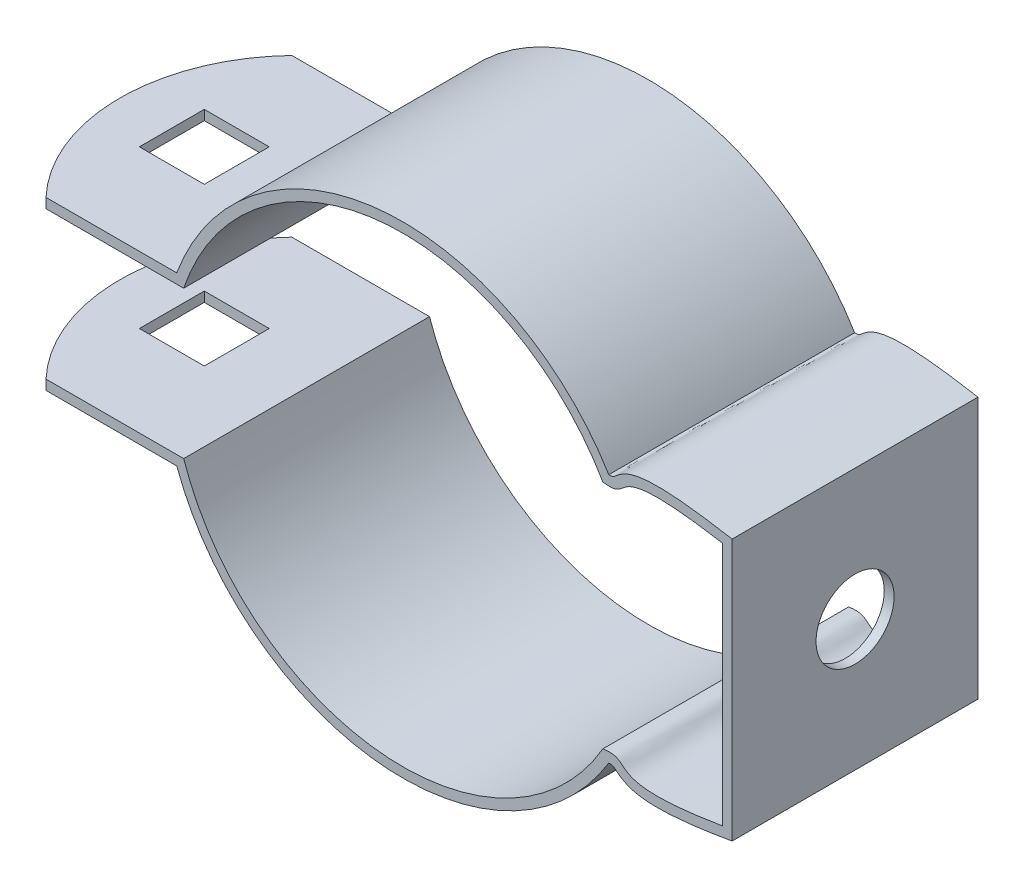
ISO-10303-21;
HEADER;
FILE_DESCRIPTION(('STEP AP214'),'2;1');
FILE_NAME('part.step','',(''),(''),'','','');
FILE_SCHEMA(('AUTOMOTIVE_DESIGN { 1 0 10303 214 1 1 1 1 }'));
ENDSEC;
DATA;
#1=APPLICATION_CONTEXT('core data for automotive mechanical design processes');
#2=APPLICATION_PROTOCOL_DEFINITION('international standard','automotive_design',2000,#1);
#3=PRODUCT_CONTEXT('',#1,'mechanical');
#4=PRODUCT('Part','Part','',(#3));
#5=PRODUCT_RELATED_PRODUCT_CATEGORY('part','',(#4));
#6=PRODUCT_DEFINITION_FORMATION('','',#4);
#7=PRODUCT_DEFINITION_CONTEXT('part definition',#1,'design');
#8=PRODUCT_DEFINITION('design','',#6,#7);
#9=PRODUCT_DEFINITION_SHAPE('','',#8);
#10=(LENGTH_UNIT() NAMED_UNIT(*) SI_UNIT(.MILLI.,.METRE.));
#11=(NAMED_UNIT(*) PLANE_ANGLE_UNIT() SI_UNIT($,.RADIAN.));
#12=(NAMED_UNIT(*) SI_UNIT($,.STERADIAN.) SOLID_ANGLE_UNIT());
#13=UNCERTAINTY_MEASURE_WITH_UNIT(LENGTH_MEASURE(1.E-05),#10,'distance_accuracy_value','');
#14=(GEOMETRIC_REPRESENTATION_CONTEXT(3) GLOBAL_UNCERTAINTY_ASSIGNED_CONTEXT((#13)) GLOBAL_UNIT_ASSIGNED_CONTEXT((#10,
#11,#12)) REPRESENTATION_CONTEXT('',''));
#15=CARTESIAN_POINT('',(0.,0.,0.));
#16=DIRECTION('',(0.,0.,1.));
#17=DIRECTION('',(1.,0.,0.));
#18=AXIS2_PLACEMENT_3D('',#15,#16,#17);
#19=CARTESIAN_POINT('',(-23.1460574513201,17.9950975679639,12.5));
#20=DIRECTION('',(0.,-1.,0.));
#21=DIRECTION('',(0.,0.,-1.));
#22=AXIS2_PLACEMENT_3D('',#19,#20,#21);
#23=CYLINDRICAL_SURFACE('',#22,18.125);
#24=CARTESIAN_POINT('',(-23.1460574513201,7.5,12.5));
#25=DIRECTION('',(0.,1.,0.));
#26=DIRECTION('',(0.,0.,1.));
#27=AXIS2_PLACEMENT_3D('',#24,#25,#26);
#28=CIRCLE('',#27,18.125);
#29=CARTESIAN_POINT('',(-36.2710574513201,7.5,25.));
#30=VERTEX_POINT('',#29);
#31=CARTESIAN_POINT('',(-36.2710574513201,7.49999999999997,0.));
#32=VERTEX_POINT('',#31);
#33=EDGE_CURVE('E267',#30,#32,#28,.F.);
#34=ORIENTED_EDGE('',*,*,#33,.F.);
#35=DIRECTION('',(0.,1.,0.));
#36=VECTOR('',#35,1.);
#37=CARTESIAN_POINT('',(-36.2710574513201,0.,25.));
#38=LINE('',#37,#36);
#39=CARTESIAN_POINT('',(-36.2710574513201,8.5,25.));
#40=VERTEX_POINT('',#39);
#41=EDGE_CURVE('E479',#30,#40,#38,.T.);
#42=ORIENTED_EDGE('',*,*,#41,.T.);
#43=CARTESIAN_POINT('',(-23.1460574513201,8.5,12.5));
#44=DIRECTION('',(0.,-1.,0.));
#45=DIRECTION('',(0.,0.,-1.));
#46=AXIS2_PLACEMENT_3D('',#43,#44,#45);
#47=CIRCLE('',#46,18.125);
#48=CARTESIAN_POINT('',(-36.2710574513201,8.49999999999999,0.));
#49=VERTEX_POINT('',#48);
#50=EDGE_CURVE('E269',#40,#49,#47,.T.);
#51=ORIENTED_EDGE('',*,*,#50,.T.);
#52=DIRECTION('',(0.,1.,0.));
#53=VECTOR('',#52,1.);
#54=CARTESIAN_POINT('',(-36.2710574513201,0.,0.));
#55=LINE('',#54,#53);
#56=EDGE_CURVE('E392',#32,#49,#55,.T.);
#57=ORIENTED_EDGE('',*,*,#56,.F.);
#58=EDGE_LOOP('',(#34,#42,#51,#57));
#59=FACE_BOUND('',#58,.T.);
#60=ADVANCED_FACE('F39',(#59),#23,.T.);
#61=CARTESIAN_POINT('',(33.5,0.,25.));
#62=DIRECTION('',(1.,0.,0.));
#63=DIRECTION('',(0.,0.,-1.));
#64=AXIS2_PLACEMENT_3D('',#61,#62,#63);
#65=PLANE('',#64);
#66=CARTESIAN_POINT('',(33.5,0.,12.5));
#67=DIRECTION('',(1.,0.,0.));
#68=DIRECTION('',(0.,0.,-1.));
#69=AXIS2_PLACEMENT_3D('',#66,#67,#68);
#70=CIRCLE('',#69,3.96875);
#71=CARTESIAN_POINT('',(33.5,0.,8.53125));
#72=VERTEX_POINT('',#71);
#73=EDGE_CURVE('E544',#72,#72,#70,.T.);
#74=ORIENTED_EDGE('',*,*,#73,.F.);
#75=EDGE_LOOP('',(#74));
#76=FACE_BOUND('',#75,.T.);
#77=DIRECTION('',(0.,-1.,0.));
#78=VECTOR('',#77,1.);
#79=CARTESIAN_POINT('',(33.5,0.,0.));
#80=LINE('',#79,#78);
#81=CARTESIAN_POINT('',(33.5,13.2980440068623,0.));
#82=VERTEX_POINT('',#81);
#83=CARTESIAN_POINT('',(33.5,-13.2980440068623,0.));
#84=VERTEX_POINT('',#83);
#85=EDGE_CURVE('E274',#82,#84,#80,.T.);
#86=ORIENTED_EDGE('',*,*,#85,.F.);
#87=DIRECTION('',(0.,0.,-1.));
#88=VECTOR('',#87,1.);
#89=CARTESIAN_POINT('',(33.5,13.2980440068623,25.));
#90=LINE('',#89,#88);
#91=CARTESIAN_POINT('',(33.5,13.2980440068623,25.));
#92=VERTEX_POINT('',#91);
#93=EDGE_CURVE('E11',#92,#82,#90,.T.);
#94=ORIENTED_EDGE('',*,*,#93,.F.);
#95=DIRECTION('',(0.,-1.,0.));
#96=VECTOR('',#95,1.);
#97=CARTESIAN_POINT('',(33.5,0.,25.));
#98=LINE('',#97,#96);
#99=CARTESIAN_POINT('',(33.5,-13.2980440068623,25.));
#100=VERTEX_POINT('',#99);
#101=EDGE_CURVE('E275',#92,#100,#98,.T.);
#102=ORIENTED_EDGE('',*,*,#101,.T.);
#103=DIRECTION('',(0.,0.,-1.));
#104=VECTOR('',#103,1.);
#105=CARTESIAN_POINT('',(33.5,-13.2980440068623,25.));
#106=LINE('',#105,#104);
#107=EDGE_CURVE('E372',#100,#84,#106,.T.);
#108=ORIENTED_EDGE('',*,*,#107,.T.);
#109=EDGE_LOOP('',(#86,#94,#102,#108));
#110=FACE_BOUND('',#109,.T.);
#111=ADVANCED_FACE('F41',(#76,#110),#65,.T.);
#112=CARTESIAN_POINT('',(33.5,13.2980440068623,25.));
#113=CARTESIAN_POINT('',(33.1257039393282,13.3613611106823,25.));
#114=CARTESIAN_POINT('',(32.366155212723,13.4916064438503,25.));
#115=CARTESIAN_POINT('',(30.9340694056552,13.7194128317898,25.));
#116=CARTESIAN_POINT('',(29.3573831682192,13.9332412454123,25.));
#117=CARTESIAN_POINT('',(27.7553723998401,14.0922761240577,25.));
#118=CARTESIAN_POINT('',(25.9681580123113,14.1876729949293,25.));
#119=CARTESIAN_POINT('',(24.3011945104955,14.1156624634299,25.));
#120=CARTESIAN_POINT('',(22.9263731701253,13.7887410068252,25.));
#121=CARTESIAN_POINT('',(21.9931802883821,13.2483976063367,25.));
#122=CARTESIAN_POINT('',(21.5780376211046,12.8712205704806,25.));
#123=CARTESIAN_POINT('',(21.4161476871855,12.7626210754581,25.));
#124=CARTESIAN_POINT('',(21.3496067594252,12.7308014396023,25.));
#125=CARTESIAN_POINT('',(21.2545690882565,12.7051360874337,25.));
#126=CARTESIAN_POINT('',(21.1154191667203,12.6914233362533,25.));
#127=CARTESIAN_POINT('',(21.0056229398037,12.6910655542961,25.));
#128=CARTESIAN_POINT('',(20.9557927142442,12.6927046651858,25.));
#129=B_SPLINE_CURVE_WITH_KNOTS('',3,(#112,#113,#114,#115,#116,#117,#118,#119,#120,#121,#122,
#123,#124,#125,#126,#127,#128),.UNSPECIFIED.,.F.,.F.,(4,1,1,1,1,1,1,1,1,1,1,1,1,1,4),
(0.0533151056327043,0.0790930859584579,0.104871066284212,0.156427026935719,0.207982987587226,
0.259538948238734,0.362650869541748,0.465762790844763,0.568874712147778,0.671986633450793,
0.7235425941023,0.775098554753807,0.826654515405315,0.852432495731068,0.878210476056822),.UNSPECIFIED.);
#130=DIRECTION('',(0.,0.,-1.));
#131=VECTOR('',#130,1.);
#132=SURFACE_OF_LINEAR_EXTRUSION('',#129,#131);
#133=CARTESIAN_POINT('',(33.5,13.2980440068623,0.));
#134=CARTESIAN_POINT('',(33.1257039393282,13.3613611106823,0.));
#135=CARTESIAN_POINT('',(32.366155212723,13.4916064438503,0.));
#136=CARTESIAN_POINT('',(30.9340694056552,13.7194128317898,0.));
#137=CARTESIAN_POINT('',(29.3573831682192,13.9332412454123,0.));
#138=CARTESIAN_POINT('',(27.7553723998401,14.0922761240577,0.));
#139=CARTESIAN_POINT('',(25.9681580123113,14.1876729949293,0.));
#140=CARTESIAN_POINT('',(24.3011945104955,14.1156624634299,0.));
#141=CARTESIAN_POINT('',(22.9263731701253,13.7887410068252,0.));
#142=CARTESIAN_POINT('',(21.9931802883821,13.2483976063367,0.));
#143=CARTESIAN_POINT('',(21.5780376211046,12.8712205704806,0.));
#144=CARTESIAN_POINT('',(21.4161476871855,12.7626210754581,0.));
#145=CARTESIAN_POINT('',(21.3496067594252,12.7308014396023,0.));
#146=CARTESIAN_POINT('',(21.2545690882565,12.7051360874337,0.));
#147=CARTESIAN_POINT('',(21.1154191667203,12.6914233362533,0.));
#148=CARTESIAN_POINT('',(21.0056229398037,12.6910655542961,0.));
#149=CARTESIAN_POINT('',(20.9557927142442,12.6927046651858,0.));
#150=B_SPLINE_CURVE_WITH_KNOTS('',3,(#133,#134,#135,#136,#137,#138,#139,#140,#141,#142,#143,
#144,#145,#146,#147,#148,#149),.UNSPECIFIED.,.F.,.F.,(4,1,1,1,1,1,1,1,1,1,1,1,1,1,4),
(0.0533151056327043,0.0790930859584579,0.104871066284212,0.156427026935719,0.207982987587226,
0.259538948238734,0.362650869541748,0.465762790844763,0.568874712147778,0.671986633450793,
0.7235425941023,0.775098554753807,0.826654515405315,0.852432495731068,0.878210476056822),.UNSPECIFIED.);
#151=CARTESIAN_POINT('',(20.9557927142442,12.6927046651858,0.));
#152=VERTEX_POINT('',#151);
#153=EDGE_CURVE('E380',#82,#152,#150,.T.);
#154=ORIENTED_EDGE('',*,*,#153,.T.);
#155=DIRECTION('',(0.,0.,-1.));
#156=VECTOR('',#155,1.);
#157=CARTESIAN_POINT('',(20.9557927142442,12.6927046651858,25.));
#158=LINE('',#157,#156);
#159=CARTESIAN_POINT('',(20.9557927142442,12.6927046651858,25.));
#160=VERTEX_POINT('',#159);
#161=EDGE_CURVE('E48',#160,#152,#158,.T.);
#162=ORIENTED_EDGE('',*,*,#161,.F.);
#163=EDGE_CURVE('E278',#92,#160,#129,.T.);
#164=ORIENTED_EDGE('',*,*,#163,.F.);
#165=ORIENTED_EDGE('',*,*,#93,.T.);
#166=EDGE_LOOP('',(#154,#162,#164,#165));
#167=FACE_BOUND('',#166,.T.);
#168=ADVANCED_FACE('F289',(#167),#132,.F.);
#169=CARTESIAN_POINT('',(0.,0.,25.));
#170=DIRECTION('',(0.,0.,-1.));
#171=DIRECTION('',(-1.,0.,0.));
#172=AXIS2_PLACEMENT_3D('',#169,#170,#171);
#173=CYLINDRICAL_SURFACE('',#172,24.5);
#174=CARTESIAN_POINT('',(0.,0.,0.));
#175=DIRECTION('',(0.,0.,1.));
#176=DIRECTION('',(1.,0.,0.));
#177=AXIS2_PLACEMENT_3D('',#174,#175,#176);
#178=CIRCLE('',#177,24.5);
#179=CARTESIAN_POINT('',(-22.9782505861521,8.49999999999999,0.));
#180=VERTEX_POINT('',#179);
#181=EDGE_CURVE('E384',#152,#180,#178,.T.);
#182=ORIENTED_EDGE('',*,*,#181,.T.);
#183=DIRECTION('',(0.,0.,-1.));
#184=VECTOR('',#183,1.);
#185=CARTESIAN_POINT('',(-22.9782505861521,8.49999999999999,25.));
#186=LINE('',#185,#184);
#187=CARTESIAN_POINT('',(-22.9782505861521,8.49999999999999,25.));
#188=VERTEX_POINT('',#187);
#189=EDGE_CURVE('E458',#188,#180,#186,.T.);
#190=ORIENTED_EDGE('',*,*,#189,.F.);
#191=CARTESIAN_POINT('',(0.,0.,25.));
#192=DIRECTION('',(0.,0.,1.));
#193=DIRECTION('',(1.,0.,0.));
#194=AXIS2_PLACEMENT_3D('',#191,#192,#193);
#195=CIRCLE('',#194,24.5);
#196=EDGE_CURVE('E284',#160,#188,#195,.T.);
#197=ORIENTED_EDGE('',*,*,#196,.F.);
#198=ORIENTED_EDGE('',*,*,#161,.T.);
#199=EDGE_LOOP('',(#182,#190,#197,#198));
#200=FACE_BOUND('',#199,.T.);
#201=ADVANCED_FACE('F292',(#200),#173,.T.);
#202=CARTESIAN_POINT('',(0.,8.5,25.));
#203=DIRECTION('',(0.,-1.,0.));
#204=DIRECTION('',(1.,0.,0.));
#205=AXIS2_PLACEMENT_3D('',#202,#203,#204);
#206=PLANE('',#205);
#207=DIRECTION('',(-1.,0.,0.));
#208=VECTOR('',#207,1.);
#209=CARTESIAN_POINT('',(0.,8.5,15.802));
#210=LINE('',#209,#208);
#211=CARTESIAN_POINT('',(-29.3742505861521,8.49999999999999,15.802));
#212=VERTEX_POINT('',#211);
#213=CARTESIAN_POINT('',(-35.9782505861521,8.49999999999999,15.802));
#214=VERTEX_POINT('',#213);
#215=EDGE_CURVE('E254',#212,#214,#210,.T.);
#216=ORIENTED_EDGE('',*,*,#215,.T.);
#217=DIRECTION('',(0.,0.,-1.));
#218=VECTOR('',#217,1.);
#219=CARTESIAN_POINT('',(-35.9782505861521,8.49999999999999,25.));
#220=LINE('',#219,#218);
#221=CARTESIAN_POINT('',(-35.9782505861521,8.49999999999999,9.198));
#222=VERTEX_POINT('',#221);
#223=EDGE_CURVE('E262',#214,#222,#220,.T.);
#224=ORIENTED_EDGE('',*,*,#223,.T.);
#225=DIRECTION('',(1.,0.,0.));
#226=VECTOR('',#225,1.);
#227=CARTESIAN_POINT('',(0.,8.5,9.198));
#228=LINE('',#227,#226);
#229=CARTESIAN_POINT('',(-29.3742505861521,8.49999999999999,9.198));
#230=VERTEX_POINT('',#229);
#231=EDGE_CURVE('E240',#222,#230,#228,.T.);
#232=ORIENTED_EDGE('',*,*,#231,.T.);
#233=DIRECTION('',(0.,0.,1.));
#234=VECTOR('',#233,1.);
#235=CARTESIAN_POINT('',(-29.3742505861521,8.49999999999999,25.));
#236=LINE('',#235,#234);
#237=EDGE_CURVE('E246',#230,#212,#236,.T.);
#238=ORIENTED_EDGE('',*,*,#237,.T.);
#239=EDGE_LOOP('',(#216,#224,#232,#238));
#240=FACE_BOUND('',#239,.T.);
#241=DIRECTION('',(-1.,0.,0.));
#242=VECTOR('',#241,1.);
#243=CARTESIAN_POINT('',(0.,8.5,0.));
#244=LINE('',#243,#242);
#245=EDGE_CURVE('E389',#180,#49,#244,.T.);
#246=ORIENTED_EDGE('',*,*,#245,.T.);
#247=ORIENTED_EDGE('',*,*,#50,.F.);
#248=DIRECTION('',(-1.,0.,0.));
#249=VECTOR('',#248,1.);
#250=CARTESIAN_POINT('',(0.,8.5,25.));
#251=LINE('',#250,#249);
#252=EDGE_CURVE('E476',#188,#40,#251,.T.);
#253=ORIENTED_EDGE('',*,*,#252,.F.);
#254=ORIENTED_EDGE('',*,*,#189,.T.);
#255=EDGE_LOOP('',(#246,#247,#253,#254));
#256=FACE_BOUND('',#255,.T.);
#257=ADVANCED_FACE('F296',(#240,#256),#206,.F.);
#258=CARTESIAN_POINT('',(0.,7.5,25.));
#259=DIRECTION('',(0.,-1.,0.));
#260=DIRECTION('',(1.,0.,0.));
#261=AXIS2_PLACEMENT_3D('',#258,#259,#260);
#262=PLANE('',#261);
#263=DIRECTION('',(0.,0.,-1.));
#264=VECTOR('',#263,1.);
#265=CARTESIAN_POINT('',(-35.9782505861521,7.5,25.));
#266=LINE('',#265,#264);
#267=CARTESIAN_POINT('',(-35.9782505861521,7.5,15.802));
#268=VERTEX_POINT('',#267);
#269=CARTESIAN_POINT('',(-35.9782505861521,7.5,9.198));
#270=VERTEX_POINT('',#269);
#271=EDGE_CURVE('E260',#268,#270,#266,.T.);
#272=ORIENTED_EDGE('',*,*,#271,.F.);
#273=DIRECTION('',(-1.,0.,0.));
#274=VECTOR('',#273,1.);
#275=CARTESIAN_POINT('',(0.,7.5,15.802));
#276=LINE('',#275,#274);
#277=CARTESIAN_POINT('',(-29.3742505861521,7.5,15.802));
#278=VERTEX_POINT('',#277);
#279=EDGE_CURVE('E252',#278,#268,#276,.T.);
#280=ORIENTED_EDGE('',*,*,#279,.F.);
#281=DIRECTION('',(0.,0.,1.));
#282=VECTOR('',#281,1.);
#283=CARTESIAN_POINT('',(-29.3742505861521,7.5,25.));
#284=LINE('',#283,#282);
#285=CARTESIAN_POINT('',(-29.3742505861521,7.5,9.198));
#286=VERTEX_POINT('',#285);
#287=EDGE_CURVE('E244',#286,#278,#284,.T.);
#288=ORIENTED_EDGE('',*,*,#287,.F.);
#289=DIRECTION('',(1.,0.,0.));
#290=VECTOR('',#289,1.);
#291=CARTESIAN_POINT('',(0.,7.5,9.198));
#292=LINE('',#291,#290);
#293=EDGE_CURVE('E238',#270,#286,#292,.T.);
#294=ORIENTED_EDGE('',*,*,#293,.F.);
#295=EDGE_LOOP('',(#272,#280,#288,#294));
#296=FACE_BOUND('',#295,.T.);
#297=DIRECTION('',(-1.,0.,0.));
#298=VECTOR('',#297,1.);
#299=CARTESIAN_POINT('',(0.,7.5,0.));
#300=LINE('',#299,#298);
#301=CARTESIAN_POINT('',(-22.2710574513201,7.5,0.));
#302=VERTEX_POINT('',#301);
#303=EDGE_CURVE('E395',#302,#32,#300,.T.);
#304=ORIENTED_EDGE('',*,*,#303,.F.);
#305=DIRECTION('',(0.,0.,-1.));
#306=VECTOR('',#305,1.);
#307=CARTESIAN_POINT('',(-22.2710574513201,7.5,25.));
#308=LINE('',#307,#306);
#309=CARTESIAN_POINT('',(-22.2710574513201,7.5,25.));
#310=VERTEX_POINT('',#309);
#311=EDGE_CURVE('E456',#310,#302,#308,.T.);
#312=ORIENTED_EDGE('',*,*,#311,.F.);
#313=DIRECTION('',(-1.,0.,0.));
#314=VECTOR('',#313,1.);
#315=CARTESIAN_POINT('',(0.,7.5,25.));
#316=LINE('',#315,#314);
#317=EDGE_CURVE('E480',#310,#30,#316,.T.);
#318=ORIENTED_EDGE('',*,*,#317,.T.);
#319=ORIENTED_EDGE('',*,*,#33,.T.);
#320=EDGE_LOOP('',(#304,#312,#318,#319));
#321=FACE_BOUND('',#320,.T.);
#322=ADVANCED_FACE('F300',(#296,#321),#262,.T.);
#323=CARTESIAN_POINT('',(0.,0.,25.));
#324=DIRECTION('',(0.,0.,-1.));
#325=DIRECTION('',(-1.,0.,0.));
#326=AXIS2_PLACEMENT_3D('',#323,#324,#325);
#327=CYLINDRICAL_SURFACE('',#326,23.5);
#328=CARTESIAN_POINT('',(0.,0.,0.));
#329=DIRECTION('',(0.,0.,1.));
#330=DIRECTION('',(1.,0.,0.));
#331=AXIS2_PLACEMENT_3D('',#328,#329,#330);
#332=CIRCLE('',#331,23.5);
#333=CARTESIAN_POINT('',(20.3515969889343,11.75,0.));
#334=VERTEX_POINT('',#333);
#335=EDGE_CURVE('E398',#334,#302,#332,.T.);
#336=ORIENTED_EDGE('',*,*,#335,.F.);
#337=DIRECTION('',(0.,0.,-1.));
#338=VECTOR('',#337,1.);
#339=CARTESIAN_POINT('',(20.3515969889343,11.75,25.));
#340=LINE('',#339,#338);
#341=CARTESIAN_POINT('',(20.3515969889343,11.75,25.));
#342=VERTEX_POINT('',#341);
#343=EDGE_CURVE('E454',#342,#334,#340,.T.);
#344=ORIENTED_EDGE('',*,*,#343,.F.);
#345=CARTESIAN_POINT('',(0.,0.,25.));
#346=DIRECTION('',(0.,0.,1.));
#347=DIRECTION('',(1.,0.,0.));
#348=AXIS2_PLACEMENT_3D('',#345,#346,#347);
#349=CIRCLE('',#348,23.5);
#350=EDGE_CURVE('E323',#342,#310,#349,.T.);
#351=ORIENTED_EDGE('',*,*,#350,.T.);
#352=ORIENTED_EDGE('',*,*,#311,.T.);
#353=EDGE_LOOP('',(#336,#344,#351,#352));
#354=FACE_BOUND('',#353,.T.);
#355=ADVANCED_FACE('F304',(#354),#327,.F.);
#356=CARTESIAN_POINT('',(20.3515969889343,11.75,25.));
#357=CARTESIAN_POINT('',(23.8433223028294,11.2163623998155,25.));
#358=CARTESIAN_POINT('',(20.0291097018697,14.5626151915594,25.));
#359=CARTESIAN_POINT('',(32.5,12.453,25.));
#360=B_SPLINE_CURVE_WITH_KNOTS('',3,(#356,#357,#358,#359),.UNSPECIFIED.,.F.,.F.,(4,4),(0.,
0.859078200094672),.UNSPECIFIED.);
#361=DIRECTION('',(0.,0.,-1.));
#362=VECTOR('',#361,1.);
#363=SURFACE_OF_LINEAR_EXTRUSION('',#360,#362);
#364=CARTESIAN_POINT('',(20.3515969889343,11.75,0.));
#365=CARTESIAN_POINT('',(23.8433223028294,11.2163623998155,0.));
#366=CARTESIAN_POINT('',(20.0291097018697,14.5626151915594,0.));
#367=CARTESIAN_POINT('',(32.5,12.453,0.));
#368=B_SPLINE_CURVE_WITH_KNOTS('',3,(#364,#365,#366,#367),.UNSPECIFIED.,.F.,.F.,(4,4),(0.,
0.859078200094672),.UNSPECIFIED.);
#369=CARTESIAN_POINT('',(32.5,12.453,0.));
#370=VERTEX_POINT('',#369);
#371=EDGE_CURVE('E401',#334,#370,#368,.T.);
#372=ORIENTED_EDGE('',*,*,#371,.T.);
#373=DIRECTION('',(0.,0.,-1.));
#374=VECTOR('',#373,1.);
#375=CARTESIAN_POINT('',(32.5,12.453,25.));
#376=LINE('',#375,#374);
#377=CARTESIAN_POINT('',(32.5,12.453,25.));
#378=VERTEX_POINT('',#377);
#379=EDGE_CURVE('E451',#378,#370,#376,.T.);
#380=ORIENTED_EDGE('',*,*,#379,.F.);
#381=EDGE_CURVE('E316',#342,#378,#360,.T.);
#382=ORIENTED_EDGE('',*,*,#381,.F.);
#383=ORIENTED_EDGE('',*,*,#343,.T.);
#384=EDGE_LOOP('',(#372,#380,#382,#383));
#385=FACE_BOUND('',#384,.T.);
#386=ADVANCED_FACE('F308',(#385),#363,.F.);
#387=CARTESIAN_POINT('',(32.5,0.,25.));
#388=DIRECTION('',(1.,0.,0.));
#389=DIRECTION('',(0.,1.,0.));
#390=AXIS2_PLACEMENT_3D('',#387,#388,#389);
#391=PLANE('',#390);
#392=CARTESIAN_POINT('',(32.5,0.,12.5));
#393=DIRECTION('',(1.,0.,0.));
#394=DIRECTION('',(0.,1.,0.));
#395=AXIS2_PLACEMENT_3D('',#392,#393,#394);
#396=CIRCLE('',#395,3.96875);
#397=CARTESIAN_POINT('',(32.5,3.96875,12.5));
#398=VERTEX_POINT('',#397);
#399=EDGE_CURVE('E43',#398,#398,#396,.T.);
#400=ORIENTED_EDGE('',*,*,#399,.T.);
#401=EDGE_LOOP('',(#400));
#402=FACE_BOUND('',#401,.T.);
#403=DIRECTION('',(0.,-1.,0.));
#404=VECTOR('',#403,1.);
#405=CARTESIAN_POINT('',(32.5,0.,0.));
#406=LINE('',#405,#404);
#407=CARTESIAN_POINT('',(32.5,-12.453,0.));
#408=VERTEX_POINT('',#407);
#409=EDGE_CURVE('E405',#370,#408,#406,.T.);
#410=ORIENTED_EDGE('',*,*,#409,.T.);
#411=DIRECTION('',(0.,0.,-1.));
#412=VECTOR('',#411,1.);
#413=CARTESIAN_POINT('',(32.5,-12.453,25.));
#414=LINE('',#413,#412);
#415=CARTESIAN_POINT('',(32.5,-12.453,25.));
#416=VERTEX_POINT('',#415);
#417=EDGE_CURVE('E449',#416,#408,#414,.T.);
#418=ORIENTED_EDGE('',*,*,#417,.F.);
#419=DIRECTION('',(0.,-1.,0.));
#420=VECTOR('',#419,1.);
#421=CARTESIAN_POINT('',(32.5,0.,25.));
#422=LINE('',#421,#420);
#423=EDGE_CURVE('E322',#378,#416,#422,.T.);
#424=ORIENTED_EDGE('',*,*,#423,.F.);
#425=ORIENTED_EDGE('',*,*,#379,.T.);
#426=EDGE_LOOP('',(#410,#418,#424,#425));
#427=FACE_BOUND('',#426,.T.);
#428=ADVANCED_FACE('F313',(#402,#427),#391,.F.);
#429=CARTESIAN_POINT('',(20.3515969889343,-11.75,25.));
#430=CARTESIAN_POINT('',(23.8433223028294,-11.2163623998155,25.));
#431=CARTESIAN_POINT('',(20.0291097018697,-14.5626151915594,25.));
#432=CARTESIAN_POINT('',(32.5,-12.453,25.));
#433=B_SPLINE_CURVE_WITH_KNOTS('',3,(#429,#430,#431,#432),.UNSPECIFIED.,.F.,.F.,(4,4),(0.,
0.859078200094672),.UNSPECIFIED.);
#434=DIRECTION('',(0.,0.,-1.));
#435=VECTOR('',#434,1.);
#436=SURFACE_OF_LINEAR_EXTRUSION('',#433,#435);
#437=CARTESIAN_POINT('',(20.3515969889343,-11.75,0.));
#438=CARTESIAN_POINT('',(23.8433223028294,-11.2163623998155,0.));
#439=CARTESIAN_POINT('',(20.0291097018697,-14.5626151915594,0.));
#440=CARTESIAN_POINT('',(32.5,-12.453,0.));
#441=B_SPLINE_CURVE_WITH_KNOTS('',3,(#437,#438,#439,#440),.UNSPECIFIED.,.F.,.F.,(4,4),(0.,
0.859078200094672),.UNSPECIFIED.);
#442=CARTESIAN_POINT('',(20.3515969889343,-11.75,0.));
#443=VERTEX_POINT('',#442);
#444=EDGE_CURVE('E411',#443,#408,#441,.T.);
#445=ORIENTED_EDGE('',*,*,#444,.F.);
#446=DIRECTION('',(0.,0.,-1.));
#447=VECTOR('',#446,1.);
#448=CARTESIAN_POINT('',(20.3515969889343,-11.75,25.));
#449=LINE('',#448,#447);
#450=CARTESIAN_POINT('',(20.3515969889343,-11.75,25.));
#451=VERTEX_POINT('',#450);
#452=EDGE_CURVE('E447',#451,#443,#449,.T.);
#453=ORIENTED_EDGE('',*,*,#452,.F.);
#454=EDGE_CURVE('E329',#451,#416,#433,.T.);
#455=ORIENTED_EDGE('',*,*,#454,.T.);
#456=ORIENTED_EDGE('',*,*,#417,.T.);
#457=EDGE_LOOP('',(#445,#453,#455,#456));
#458=FACE_BOUND('',#457,.T.);
#459=ADVANCED_FACE('F340',(#458),#436,.T.);
#460=CARTESIAN_POINT('',(0.,0.,25.));
#461=DIRECTION('',(0.,0.,-1.));
#462=DIRECTION('',(-1.,0.,0.));
#463=AXIS2_PLACEMENT_3D('',#460,#461,#462);
#464=CYLINDRICAL_SURFACE('',#463,23.5);
#465=CARTESIAN_POINT('',(0.,0.,0.));
#466=DIRECTION('',(0.,0.,1.));
#467=DIRECTION('',(1.,0.,0.));
#468=AXIS2_PLACEMENT_3D('',#465,#466,#467);
#469=CIRCLE('',#468,23.5);
#470=CARTESIAN_POINT('',(-22.2710574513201,-7.5,0.));
#471=VERTEX_POINT('',#470);
#472=EDGE_CURVE('E416',#471,#443,#469,.T.);
#473=ORIENTED_EDGE('',*,*,#472,.F.);
#474=DIRECTION('',(0.,0.,-1.));
#475=VECTOR('',#474,1.);
#476=CARTESIAN_POINT('',(-22.2710574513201,-7.5,25.));
#477=LINE('',#476,#475);
#478=CARTESIAN_POINT('',(-22.2710574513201,-7.5,25.));
#479=VERTEX_POINT('',#478);
#480=EDGE_CURVE('E445',#479,#471,#477,.T.);
#481=ORIENTED_EDGE('',*,*,#480,.F.);
#482=CARTESIAN_POINT('',(0.,0.,25.));
#483=DIRECTION('',(0.,0.,1.));
#484=DIRECTION('',(1.,0.,0.));
#485=AXIS2_PLACEMENT_3D('',#482,#483,#484);
#486=CIRCLE('',#485,23.5);
#487=EDGE_CURVE('E335',#479,#451,#486,.T.);
#488=ORIENTED_EDGE('',*,*,#487,.T.);
#489=ORIENTED_EDGE('',*,*,#452,.T.);
#490=EDGE_LOOP('',(#473,#481,#488,#489));
#491=FACE_BOUND('',#490,.T.);
#492=ADVANCED_FACE('F343',(#491),#464,.F.);
#493=CARTESIAN_POINT('',(0.,-7.5,25.));
#494=DIRECTION('',(0.,-1.,0.));
#495=DIRECTION('',(1.,0.,0.));
#496=AXIS2_PLACEMENT_3D('',#493,#494,#495);
#497=PLANE('',#496);
#498=DIRECTION('',(-1.,0.,0.));
#499=VECTOR('',#498,1.);
#500=CARTESIAN_POINT('',(0.,-7.5,15.802));
#501=LINE('',#500,#499);
#502=CARTESIAN_POINT('',(-29.3742505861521,-7.5,15.802));
#503=VERTEX_POINT('',#502);
#504=CARTESIAN_POINT('',(-35.9782505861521,-7.5,15.802));
#505=VERTEX_POINT('',#504);
#506=EDGE_CURVE('E249',#503,#505,#501,.T.);
#507=ORIENTED_EDGE('',*,*,#506,.T.);
#508=DIRECTION('',(0.,0.,-1.));
#509=VECTOR('',#508,1.);
#510=CARTESIAN_POINT('',(-35.9782505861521,-7.5,25.));
#511=LINE('',#510,#509);
#512=CARTESIAN_POINT('',(-35.9782505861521,-7.5,9.198));
#513=VERTEX_POINT('',#512);
#514=EDGE_CURVE('E257',#505,#513,#511,.T.);
#515=ORIENTED_EDGE('',*,*,#514,.T.);
#516=DIRECTION('',(1.,0.,0.));
#517=VECTOR('',#516,1.);
#518=CARTESIAN_POINT('',(0.,-7.5,9.198));
#519=LINE('',#518,#517);
#520=CARTESIAN_POINT('',(-29.3742505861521,-7.5,9.198));
#521=VERTEX_POINT('',#520);
#522=EDGE_CURVE('E236',#513,#521,#519,.T.);
#523=ORIENTED_EDGE('',*,*,#522,.T.);
#524=DIRECTION('',(0.,0.,1.));
#525=VECTOR('',#524,1.);
#526=CARTESIAN_POINT('',(-29.3742505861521,-7.5,25.));
#527=LINE('',#526,#525);
#528=EDGE_CURVE('E207',#521,#503,#527,.T.);
#529=ORIENTED_EDGE('',*,*,#528,.T.);
#530=EDGE_LOOP('',(#507,#515,#523,#529));
#531=FACE_BOUND('',#530,.T.);
#532=DIRECTION('',(-1.,0.,0.));
#533=VECTOR('',#532,1.);
#534=CARTESIAN_POINT('',(0.,-7.5,0.));
#535=LINE('',#534,#533);
#536=CARTESIAN_POINT('',(-36.2710574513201,-7.5,0.));
#537=VERTEX_POINT('',#536);
#538=EDGE_CURVE('E422',#471,#537,#535,.T.);
#539=ORIENTED_EDGE('',*,*,#538,.T.);
#540=CARTESIAN_POINT('',(-23.1460574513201,-7.5,12.5));
#541=DIRECTION('',(0.,-1.,0.));
#542=DIRECTION('',(0.,0.,-1.));
#543=AXIS2_PLACEMENT_3D('',#540,#541,#542);
#544=CIRCLE('',#543,18.125);
#545=CARTESIAN_POINT('',(-36.2710574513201,-7.5,25.));
#546=VERTEX_POINT('',#545);
#547=EDGE_CURVE('E265',#537,#546,#544,.F.);
#548=ORIENTED_EDGE('',*,*,#547,.T.);
#549=DIRECTION('',(-1.,0.,0.));
#550=VECTOR('',#549,1.);
#551=CARTESIAN_POINT('',(0.,-7.5,25.));
#552=LINE('',#551,#550);
#553=EDGE_CURVE('E505',#479,#546,#552,.T.);
#554=ORIENTED_EDGE('',*,*,#553,.F.);
#555=ORIENTED_EDGE('',*,*,#480,.T.);
#556=EDGE_LOOP('',(#539,#548,#554,#555));
#557=FACE_BOUND('',#556,.T.);
#558=ADVANCED_FACE('F347',(#531,#557),#497,.F.);
#559=CARTESIAN_POINT('',(0.,-8.5,25.));
#560=DIRECTION('',(0.,-1.,0.));
#561=DIRECTION('',(0.,0.,-1.));
#562=AXIS2_PLACEMENT_3D('',#559,#560,#561);
#563=PLANE('',#562);
#564=DIRECTION('',(0.,0.,-1.));
#565=VECTOR('',#564,1.);
#566=CARTESIAN_POINT('',(-35.9782505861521,-8.5,15.802));
#567=LINE('',#566,#565);
#568=CARTESIAN_POINT('',(-35.9782505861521,-8.5,15.802));
#569=VERTEX_POINT('',#568);
#570=CARTESIAN_POINT('',(-35.9782505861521,-8.5,9.198));
#571=VERTEX_POINT('',#570);
#572=EDGE_CURVE('E219',#569,#571,#567,.T.);
#573=ORIENTED_EDGE('',*,*,#572,.F.);
#574=DIRECTION('',(-1.,0.,0.));
#575=VECTOR('',#574,1.);
#576=CARTESIAN_POINT('',(-35.9782505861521,-8.5,15.802));
#577=LINE('',#576,#575);
#578=CARTESIAN_POINT('',(-29.3742505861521,-8.5,15.802));
#579=VERTEX_POINT('',#578);
#580=EDGE_CURVE('E224',#579,#569,#577,.T.);
#581=ORIENTED_EDGE('',*,*,#580,.F.);
#582=DIRECTION('',(0.,0.,1.));
#583=VECTOR('',#582,1.);
#584=CARTESIAN_POINT('',(-29.3742505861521,-8.5,15.802));
#585=LINE('',#584,#583);
#586=CARTESIAN_POINT('',(-29.3742505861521,-8.5,9.198));
#587=VERTEX_POINT('',#586);
#588=EDGE_CURVE('E204',#587,#579,#585,.T.);
#589=ORIENTED_EDGE('',*,*,#588,.F.);
#590=DIRECTION('',(1.,0.,0.));
#591=VECTOR('',#590,1.);
#592=CARTESIAN_POINT('',(-35.9782505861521,-8.5,9.198));
#593=LINE('',#592,#591);
#594=EDGE_CURVE('E213',#571,#587,#593,.T.);
#595=ORIENTED_EDGE('',*,*,#594,.F.);
#596=EDGE_LOOP('',(#573,#581,#589,#595));
#597=FACE_BOUND('',#596,.T.);
#598=DIRECTION('',(-1.,0.,0.));
#599=VECTOR('',#598,1.);
#600=CARTESIAN_POINT('',(0.,-8.5,0.));
#601=LINE('',#600,#599);
#602=CARTESIAN_POINT('',(-22.9782505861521,-8.5,0.));
#603=VERTEX_POINT('',#602);
#604=CARTESIAN_POINT('',(-36.2710574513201,-8.5,0.));
#605=VERTEX_POINT('',#604);
#606=EDGE_CURVE('E428',#603,#605,#601,.T.);
#607=ORIENTED_EDGE('',*,*,#606,.F.);
#608=DIRECTION('',(0.,0.,-1.));
#609=VECTOR('',#608,1.);
#610=CARTESIAN_POINT('',(-22.9782505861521,-8.5,25.));
#611=LINE('',#610,#609);
#612=CARTESIAN_POINT('',(-22.9782505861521,-8.5,25.));
#613=VERTEX_POINT('',#612);
#614=EDGE_CURVE('E443',#613,#603,#611,.T.);
#615=ORIENTED_EDGE('',*,*,#614,.F.);
#616=DIRECTION('',(-1.,0.,0.));
#617=VECTOR('',#616,1.);
#618=CARTESIAN_POINT('',(0.,-8.5,25.));
#619=LINE('',#618,#617);
#620=CARTESIAN_POINT('',(-36.2710574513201,-8.5,25.));
#621=VERTEX_POINT('',#620);
#622=EDGE_CURVE('E507',#613,#621,#619,.T.);
#623=ORIENTED_EDGE('',*,*,#622,.T.);
#624=CARTESIAN_POINT('',(-23.1460574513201,-8.5,12.5));
#625=DIRECTION('',(0.,-1.,0.));
#626=DIRECTION('',(0.,0.,-1.));
#627=AXIS2_PLACEMENT_3D('',#624,#625,#626);
#628=CIRCLE('',#627,18.125);
#629=EDGE_CURVE('E271',#621,#605,#628,.T.);
#630=ORIENTED_EDGE('',*,*,#629,.T.);
#631=EDGE_LOOP('',(#607,#615,#623,#630));
#632=FACE_BOUND('',#631,.T.);
#633=ADVANCED_FACE('F221',(#597,#632),#563,.T.);
#634=CARTESIAN_POINT('',(0.,0.,25.));
#635=DIRECTION('',(0.,0.,-1.));
#636=DIRECTION('',(-1.,0.,0.));
#637=AXIS2_PLACEMENT_3D('',#634,#635,#636);
#638=CYLINDRICAL_SURFACE('',#637,24.5);
#639=CARTESIAN_POINT('',(0.,0.,0.));
#640=DIRECTION('',(0.,0.,1.));
#641=DIRECTION('',(1.,0.,0.));
#642=AXIS2_PLACEMENT_3D('',#639,#640,#641);
#643=CIRCLE('',#642,24.5);
#644=CARTESIAN_POINT('',(20.9557927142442,-12.6927046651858,0.));
#645=VERTEX_POINT('',#644);
#646=EDGE_CURVE('E430',#603,#645,#643,.T.);
#647=ORIENTED_EDGE('',*,*,#646,.T.);
#648=DIRECTION('',(0.,0.,-1.));
#649=VECTOR('',#648,1.);
#650=CARTESIAN_POINT('',(20.9557927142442,-12.6927046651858,25.));
#651=LINE('',#650,#649);
#652=CARTESIAN_POINT('',(20.9557927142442,-12.6927046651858,25.));
#653=VERTEX_POINT('',#652);
#654=EDGE_CURVE('E440',#653,#645,#651,.T.);
#655=ORIENTED_EDGE('',*,*,#654,.F.);
#656=CARTESIAN_POINT('',(0.,0.,25.));
#657=DIRECTION('',(0.,0.,1.));
#658=DIRECTION('',(1.,0.,0.));
#659=AXIS2_PLACEMENT_3D('',#656,#657,#658);
#660=CIRCLE('',#659,24.5);
#661=EDGE_CURVE('E373',#613,#653,#660,.T.);
#662=ORIENTED_EDGE('',*,*,#661,.F.);
#663=ORIENTED_EDGE('',*,*,#614,.T.);
#664=EDGE_LOOP('',(#647,#655,#662,#663));
#665=FACE_BOUND('',#664,.T.);
#666=ADVANCED_FACE('F354',(#665),#638,.T.);
#667=CARTESIAN_POINT('',(20.9557927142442,-12.6927046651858,25.));
#668=CARTESIAN_POINT('',(21.0056229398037,-12.6910655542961,25.));
#669=CARTESIAN_POINT('',(21.1154191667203,-12.6914233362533,25.));
#670=CARTESIAN_POINT('',(21.2545690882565,-12.7051360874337,25.));
#671=CARTESIAN_POINT('',(21.3496067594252,-12.7308014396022,25.));
#672=CARTESIAN_POINT('',(21.4161476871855,-12.7626210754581,25.));
#673=CARTESIAN_POINT('',(21.5780376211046,-12.8712205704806,25.));
#674=CARTESIAN_POINT('',(21.9931802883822,-13.2483976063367,25.));
#675=CARTESIAN_POINT('',(22.9263731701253,-13.7887410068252,25.));
#676=CARTESIAN_POINT('',(24.3011945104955,-14.1156624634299,25.));
#677=CARTESIAN_POINT('',(25.9681580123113,-14.1876729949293,25.));
#678=CARTESIAN_POINT('',(27.7553723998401,-14.0922761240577,25.));
#679=CARTESIAN_POINT('',(29.3573831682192,-13.9332412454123,25.));
#680=CARTESIAN_POINT('',(30.9340694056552,-13.7194128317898,25.));
#681=CARTESIAN_POINT('',(32.366155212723,-13.4916064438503,25.));
#682=CARTESIAN_POINT('',(33.1257039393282,-13.3613611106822,25.));
#683=CARTESIAN_POINT('',(33.5,-13.2980440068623,25.));
#684=B_SPLINE_CURVE_WITH_KNOTS('',3,(#667,#668,#669,#670,#671,#672,#673,#674,#675,#676,#677,
#678,#679,#680,#681,#682,#683),.UNSPECIFIED.,.F.,.F.,(4,1,1,1,1,1,1,1,1,1,1,1,1,1,4),
(0.0533151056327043,0.079093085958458,0.104871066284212,0.156427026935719,0.207982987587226,
0.259538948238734,0.362650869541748,0.465762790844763,0.568874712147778,0.671986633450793,
0.7235425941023,0.775098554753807,0.826654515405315,0.852432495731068,0.878210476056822),.UNSPECIFIED.);
#685=DIRECTION('',(0.,0.,-1.));
#686=VECTOR('',#685,1.);
#687=SURFACE_OF_LINEAR_EXTRUSION('',#684,#686);
#688=CARTESIAN_POINT('',(20.9557927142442,-12.6927046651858,0.));
#689=CARTESIAN_POINT('',(21.0056229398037,-12.6910655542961,0.));
#690=CARTESIAN_POINT('',(21.1154191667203,-12.6914233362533,0.));
#691=CARTESIAN_POINT('',(21.2545690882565,-12.7051360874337,0.));
#692=CARTESIAN_POINT('',(21.3496067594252,-12.7308014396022,0.));
#693=CARTESIAN_POINT('',(21.4161476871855,-12.7626210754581,0.));
#694=CARTESIAN_POINT('',(21.5780376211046,-12.8712205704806,0.));
#695=CARTESIAN_POINT('',(21.9931802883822,-13.2483976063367,0.));
#696=CARTESIAN_POINT('',(22.9263731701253,-13.7887410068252,0.));
#697=CARTESIAN_POINT('',(24.3011945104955,-14.1156624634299,0.));
#698=CARTESIAN_POINT('',(25.9681580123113,-14.1876729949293,0.));
#699=CARTESIAN_POINT('',(27.7553723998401,-14.0922761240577,0.));
#700=CARTESIAN_POINT('',(29.3573831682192,-13.9332412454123,0.));
#701=CARTESIAN_POINT('',(30.9340694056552,-13.7194128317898,0.));
#702=CARTESIAN_POINT('',(32.366155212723,-13.4916064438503,0.));
#703=CARTESIAN_POINT('',(33.1257039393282,-13.3613611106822,0.));
#704=CARTESIAN_POINT('',(33.5,-13.2980440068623,0.));
#705=B_SPLINE_CURVE_WITH_KNOTS('',3,(#688,#689,#690,#691,#692,#693,#694,#695,#696,#697,#698,
#699,#700,#701,#702,#703,#704),.UNSPECIFIED.,.F.,.F.,(4,1,1,1,1,1,1,1,1,1,1,1,1,1,4),
(0.0533151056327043,0.079093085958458,0.104871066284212,0.156427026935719,0.207982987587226,
0.259538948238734,0.362650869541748,0.465762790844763,0.568874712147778,0.671986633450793,
0.7235425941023,0.775098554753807,0.826654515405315,0.852432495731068,0.878210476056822),.UNSPECIFIED.);
#706=EDGE_CURVE('E279',#645,#84,#705,.T.);
#707=ORIENTED_EDGE('',*,*,#706,.T.);
#708=ORIENTED_EDGE('',*,*,#107,.F.);
#709=EDGE_CURVE('E366',#653,#100,#684,.T.);
#710=ORIENTED_EDGE('',*,*,#709,.F.);
#711=ORIENTED_EDGE('',*,*,#654,.T.);
#712=EDGE_LOOP('',(#707,#708,#710,#711));
#713=FACE_BOUND('',#712,.T.);
#714=ADVANCED_FACE('F357',(#713),#687,.F.);
#715=CARTESIAN_POINT('',(0.,0.,25.));
#716=DIRECTION('',(0.,0.,1.));
#717=DIRECTION('',(1.,0.,0.));
#718=AXIS2_PLACEMENT_3D('',#715,#716,#717);
#719=PLANE('',#718);
#720=ORIENTED_EDGE('',*,*,#101,.F.);
#721=ORIENTED_EDGE('',*,*,#163,.T.);
#722=ORIENTED_EDGE('',*,*,#196,.T.);
#723=ORIENTED_EDGE('',*,*,#252,.T.);
#724=ORIENTED_EDGE('',*,*,#41,.F.);
#725=ORIENTED_EDGE('',*,*,#317,.F.);
#726=ORIENTED_EDGE('',*,*,#350,.F.);
#727=ORIENTED_EDGE('',*,*,#381,.T.);
#728=ORIENTED_EDGE('',*,*,#423,.T.);
#729=ORIENTED_EDGE('',*,*,#454,.F.);
#730=ORIENTED_EDGE('',*,*,#487,.F.);
#731=ORIENTED_EDGE('',*,*,#553,.T.);
#732=DIRECTION('',(0.,-1.,0.));
#733=VECTOR('',#732,1.);
#734=CARTESIAN_POINT('',(-36.2710574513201,0.,25.));
#735=LINE('',#734,#733);
#736=EDGE_CURVE('E506',#546,#621,#735,.T.);
#737=ORIENTED_EDGE('',*,*,#736,.T.);
#738=ORIENTED_EDGE('',*,*,#622,.F.);
#739=ORIENTED_EDGE('',*,*,#661,.T.);
#740=ORIENTED_EDGE('',*,*,#709,.T.);
#741=EDGE_LOOP('',(#720,#721,#722,#723,#724,#725,#726,#727,#728,#729,#730,#731,#737,#738,#739,#740));
#742=FACE_BOUND('',#741,.T.);
#743=ADVANCED_FACE('F362',(#742),#719,.T.);
#744=CARTESIAN_POINT('',(0.,0.,0.));
#745=DIRECTION('',(0.,0.,1.));
#746=DIRECTION('',(1.,0.,0.));
#747=AXIS2_PLACEMENT_3D('',#744,#745,#746);
#748=PLANE('',#747);
#749=ORIENTED_EDGE('',*,*,#85,.T.);
#750=ORIENTED_EDGE('',*,*,#706,.F.);
#751=ORIENTED_EDGE('',*,*,#646,.F.);
#752=ORIENTED_EDGE('',*,*,#606,.T.);
#753=DIRECTION('',(0.,-1.,0.));
#754=VECTOR('',#753,1.);
#755=CARTESIAN_POINT('',(-36.2710574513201,0.,0.));
#756=LINE('',#755,#754);
#757=EDGE_CURVE('E425',#537,#605,#756,.T.);
#758=ORIENTED_EDGE('',*,*,#757,.F.);
#759=ORIENTED_EDGE('',*,*,#538,.F.);
#760=ORIENTED_EDGE('',*,*,#472,.T.);
#761=ORIENTED_EDGE('',*,*,#444,.T.);
#762=ORIENTED_EDGE('',*,*,#409,.F.);
#763=ORIENTED_EDGE('',*,*,#371,.F.);
#764=ORIENTED_EDGE('',*,*,#335,.T.);
#765=ORIENTED_EDGE('',*,*,#303,.T.);
#766=ORIENTED_EDGE('',*,*,#56,.T.);
#767=ORIENTED_EDGE('',*,*,#245,.F.);
#768=ORIENTED_EDGE('',*,*,#181,.F.);
#769=ORIENTED_EDGE('',*,*,#153,.F.);
#770=EDGE_LOOP('',(#749,#750,#751,#752,#758,#759,#760,#761,#762,#763,#764,#765,#766,#767,#768,#769));
#771=FACE_BOUND('',#770,.T.);
#772=ADVANCED_FACE('F364',(#771),#748,.F.);
#773=ORIENTED_EDGE('',*,*,#547,.F.);
#774=ORIENTED_EDGE('',*,*,#757,.T.);
#775=ORIENTED_EDGE('',*,*,#629,.F.);
#776=ORIENTED_EDGE('',*,*,#736,.F.);
#777=EDGE_LOOP('',(#773,#774,#775,#776));
#778=FACE_BOUND('',#777,.T.);
#779=ADVANCED_FACE('F523',(#778),#23,.T.);
#780=CARTESIAN_POINT('',(-35.9782505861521,16.5,9.198));
#781=DIRECTION('',(0.,0.,-1.));
#782=DIRECTION('',(-1.,0.,0.));
#783=AXIS2_PLACEMENT_3D('',#780,#781,#782);
#784=PLANE('',#783);
#785=DIRECTION('',(0.,-1.,0.));
#786=VECTOR('',#785,1.);
#787=CARTESIAN_POINT('',(-35.9782505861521,16.5,9.198));
#788=LINE('',#787,#786);
#789=EDGE_CURVE('E216',#513,#571,#788,.T.);
#790=ORIENTED_EDGE('',*,*,#789,.T.);
#791=ORIENTED_EDGE('',*,*,#594,.T.);
#792=DIRECTION('',(0.,-1.,0.));
#793=VECTOR('',#792,1.);
#794=CARTESIAN_POINT('',(-29.3742505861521,16.5,9.198));
#795=LINE('',#794,#793);
#796=EDGE_CURVE('E199',#521,#587,#795,.T.);
#797=ORIENTED_EDGE('',*,*,#796,.F.);
#798=ORIENTED_EDGE('',*,*,#522,.F.);
#799=EDGE_LOOP('',(#790,#791,#797,#798));
#800=FACE_BOUND('',#799,.T.);
#801=ADVANCED_FACE('F214',(#800),#784,.F.);
#802=CARTESIAN_POINT('',(-29.3742505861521,16.5,15.802));
#803=DIRECTION('',(1.,0.,0.));
#804=DIRECTION('',(0.,0.,-1.));
#805=AXIS2_PLACEMENT_3D('',#802,#803,#804);
#806=PLANE('',#805);
#807=ORIENTED_EDGE('',*,*,#796,.T.);
#808=ORIENTED_EDGE('',*,*,#588,.T.);
#809=DIRECTION('',(0.,-1.,0.));
#810=VECTOR('',#809,1.);
#811=CARTESIAN_POINT('',(-29.3742505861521,16.5,15.802));
#812=LINE('',#811,#810);
#813=EDGE_CURVE('E233',#503,#579,#812,.T.);
#814=ORIENTED_EDGE('',*,*,#813,.F.);
#815=ORIENTED_EDGE('',*,*,#528,.F.);
#816=EDGE_LOOP('',(#807,#808,#814,#815));
#817=FACE_BOUND('',#816,.T.);
#818=ADVANCED_FACE('F201',(#817),#806,.F.);
#819=CARTESIAN_POINT('',(-35.9782505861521,16.5,15.802));
#820=DIRECTION('',(0.,0.,1.));
#821=DIRECTION('',(1.,0.,0.));
#822=AXIS2_PLACEMENT_3D('',#819,#820,#821);
#823=PLANE('',#822);
#824=ORIENTED_EDGE('',*,*,#813,.T.);
#825=ORIENTED_EDGE('',*,*,#580,.T.);
#826=DIRECTION('',(0.,-1.,0.));
#827=VECTOR('',#826,1.);
#828=CARTESIAN_POINT('',(-35.9782505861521,16.5,15.802));
#829=LINE('',#828,#827);
#830=EDGE_CURVE('E229',#505,#569,#829,.T.);
#831=ORIENTED_EDGE('',*,*,#830,.F.);
#832=ORIENTED_EDGE('',*,*,#506,.F.);
#833=EDGE_LOOP('',(#824,#825,#831,#832));
#834=FACE_BOUND('',#833,.T.);
#835=ADVANCED_FACE('F552',(#834),#823,.F.);
#836=CARTESIAN_POINT('',(-35.9782505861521,16.5,15.802));
#837=DIRECTION('',(-1.,0.,0.));
#838=DIRECTION('',(0.,0.,1.));
#839=AXIS2_PLACEMENT_3D('',#836,#837,#838);
#840=PLANE('',#839);
#841=ORIENTED_EDGE('',*,*,#830,.T.);
#842=ORIENTED_EDGE('',*,*,#572,.T.);
#843=ORIENTED_EDGE('',*,*,#789,.F.);
#844=ORIENTED_EDGE('',*,*,#514,.F.);
#845=EDGE_LOOP('',(#841,#842,#843,#844));
#846=FACE_BOUND('',#845,.T.);
#847=ADVANCED_FACE('F549',(#846),#840,.F.);
#848=EDGE_CURVE('E231',#214,#268,#829,.T.);
#849=ORIENTED_EDGE('',*,*,#848,.T.);
#850=ORIENTED_EDGE('',*,*,#271,.T.);
#851=EDGE_CURVE('E60',#222,#270,#788,.T.);
#852=ORIENTED_EDGE('',*,*,#851,.F.);
#853=ORIENTED_EDGE('',*,*,#223,.F.);
#854=EDGE_LOOP('',(#849,#850,#852,#853));
#855=FACE_BOUND('',#854,.T.);
#856=ADVANCED_FACE('F560',(#855),#840,.F.);
#857=EDGE_CURVE('E232',#212,#278,#812,.T.);
#858=ORIENTED_EDGE('',*,*,#857,.T.);
#859=ORIENTED_EDGE('',*,*,#279,.T.);
#860=ORIENTED_EDGE('',*,*,#848,.F.);
#861=ORIENTED_EDGE('',*,*,#215,.F.);
#862=EDGE_LOOP('',(#858,#859,#860,#861));
#863=FACE_BOUND('',#862,.T.);
#864=ADVANCED_FACE('F555',(#863),#823,.F.);
#865=EDGE_CURVE('E55',#230,#286,#795,.T.);
#866=ORIENTED_EDGE('',*,*,#865,.T.);
#867=ORIENTED_EDGE('',*,*,#287,.T.);
#868=ORIENTED_EDGE('',*,*,#857,.F.);
#869=ORIENTED_EDGE('',*,*,#237,.F.);
#870=EDGE_LOOP('',(#866,#867,#868,#869));
#871=FACE_BOUND('',#870,.T.);
#872=ADVANCED_FACE('F562',(#871),#806,.F.);
#873=ORIENTED_EDGE('',*,*,#851,.T.);
#874=ORIENTED_EDGE('',*,*,#293,.T.);
#875=ORIENTED_EDGE('',*,*,#865,.F.);
#876=ORIENTED_EDGE('',*,*,#231,.F.);
#877=EDGE_LOOP('',(#873,#874,#875,#876));
#878=FACE_BOUND('',#877,.T.);
#879=ADVANCED_FACE('F533',(#878),#784,.F.);
#880=CARTESIAN_POINT('',(8.5,0.,12.5));
#881=DIRECTION('',(1.,0.,0.));
#882=DIRECTION('',(0.,0.,-1.));
#883=AXIS2_PLACEMENT_3D('',#880,#881,#882);
#884=CYLINDRICAL_SURFACE('',#883,3.96875);
#885=ORIENTED_EDGE('',*,*,#73,.T.);
#886=EDGE_LOOP('',(#885));
#887=FACE_BOUND('',#886,.T.);
#888=ORIENTED_EDGE('',*,*,#399,.F.);
#889=EDGE_LOOP('',(#888));
#890=FACE_BOUND('',#889,.T.);
#891=ADVANCED_FACE('F581',(#887,#890),#884,.F.);
#892=CLOSED_SHELL('',(#60,#111,#168,#201,#257,#322,#355,#386,#428,#459,#492,#558,#633,#666,#714,
#743,#772,#779,#801,#818,#835,#847,#856,#864,#872,#879,#891));
#893=MANIFOLD_SOLID_BREP('B2',#892);
#894=ADVANCED_BREP_SHAPE_REPRESENTATION('',(#18,#893),#14);
#895=SHAPE_DEFINITION_REPRESENTATION(#9,#894);
ENDSEC;
END-ISO-10303-21;
